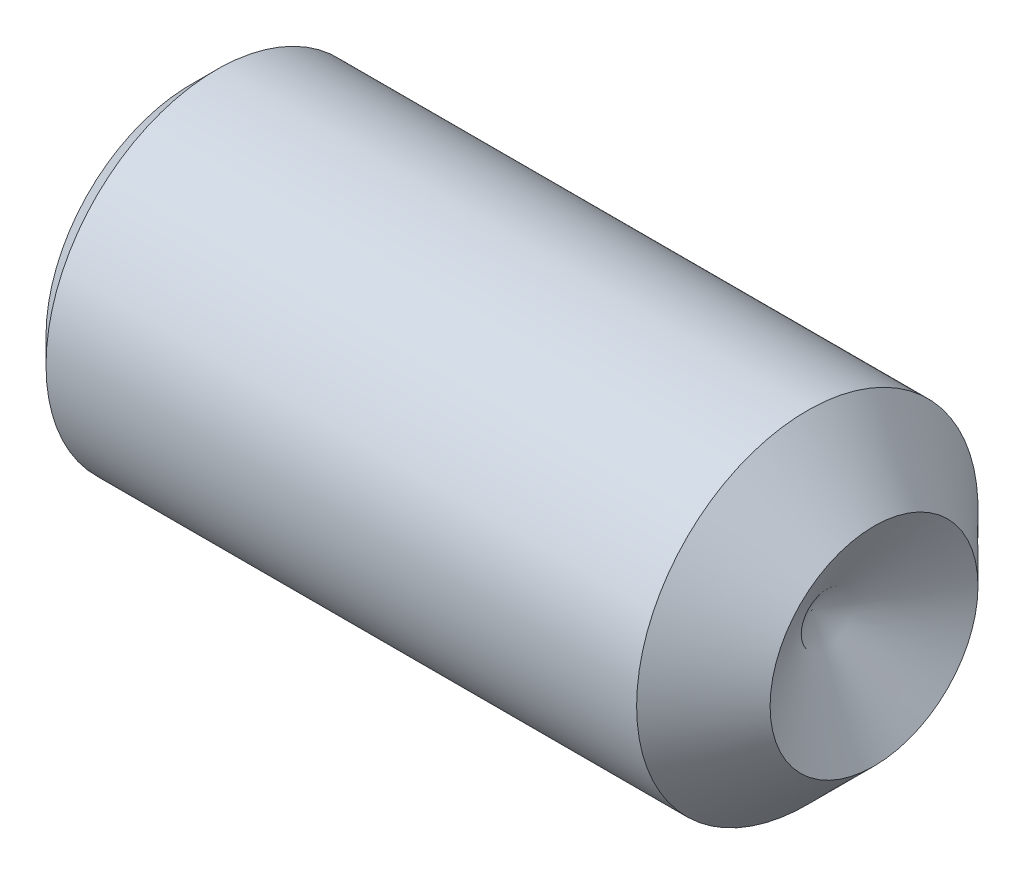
ISO-10303-21;
HEADER;
FILE_DESCRIPTION(('STEP AP214'),'2;1');
FILE_NAME('part.step','',(''),(''),'','','');
FILE_SCHEMA(('AUTOMOTIVE_DESIGN { 1 0 10303 214 1 1 1 1 }'));
ENDSEC;
DATA;
#1=APPLICATION_CONTEXT('core data for automotive mechanical design processes');
#2=APPLICATION_PROTOCOL_DEFINITION('international standard','automotive_design',2000,#1);
#3=PRODUCT_CONTEXT('',#1,'mechanical');
#4=PRODUCT('Part','Part','',(#3));
#5=PRODUCT_RELATED_PRODUCT_CATEGORY('part','',(#4));
#6=PRODUCT_DEFINITION_FORMATION('','',#4);
#7=PRODUCT_DEFINITION_CONTEXT('part definition',#1,'design');
#8=PRODUCT_DEFINITION('design','',#6,#7);
#9=PRODUCT_DEFINITION_SHAPE('','',#8);
#10=(LENGTH_UNIT() NAMED_UNIT(*) SI_UNIT(.MILLI.,.METRE.));
#11=(NAMED_UNIT(*) PLANE_ANGLE_UNIT() SI_UNIT($,.RADIAN.));
#12=(NAMED_UNIT(*) SI_UNIT($,.STERADIAN.) SOLID_ANGLE_UNIT());
#13=UNCERTAINTY_MEASURE_WITH_UNIT(LENGTH_MEASURE(1.E-05),#10,'distance_accuracy_value','');
#14=(GEOMETRIC_REPRESENTATION_CONTEXT(3) GLOBAL_UNCERTAINTY_ASSIGNED_CONTEXT((#13)) GLOBAL_UNIT_ASSIGNED_CONTEXT((#10,
#11,#12)) REPRESENTATION_CONTEXT('',''));
#15=CARTESIAN_POINT('',(0.,0.,0.));
#16=DIRECTION('',(0.,0.,1.));
#17=DIRECTION('',(1.,0.,0.));
#18=AXIS2_PLACEMENT_3D('',#15,#16,#17);
#19=CARTESIAN_POINT('',(0.,0.,0.));
#20=DIRECTION('',(-1.,0.,0.));
#21=DIRECTION('',(0.,0.,1.));
#22=AXIS2_PLACEMENT_3D('',#19,#20,#21);
#23=PLANE('',#22);
#24=CARTESIAN_POINT('',(0.,0.,0.));
#25=DIRECTION('',(-1.,0.,0.));
#26=DIRECTION('',(0.,0.,1.));
#27=AXIS2_PLACEMENT_3D('',#24,#25,#26);
#28=CIRCLE('',#27,10.81024);
#29=CARTESIAN_POINT('',(0.,0.,10.81024));
#30=VERTEX_POINT('',#29);
#31=EDGE_CURVE('E11',#30,#30,#28,.T.);
#32=ORIENTED_EDGE('',*,*,#31,.T.);
#33=EDGE_LOOP('',(#32));
#34=FACE_BOUND('',#33,.T.);
#35=DIRECTION('',(0.,0.,-1.));
#36=VECTOR('',#35,1.);
#37=CARTESIAN_POINT('',(0.,7.1374,4.12077981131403));
#38=LINE('',#37,#36);
#39=CARTESIAN_POINT('',(0.,7.1374,4.12077981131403));
#40=VERTEX_POINT('',#39);
#41=CARTESIAN_POINT('',(0.,7.1374,-4.12077981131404));
#42=VERTEX_POINT('',#41);
#43=EDGE_CURVE('E100',#40,#42,#38,.T.);
#44=ORIENTED_EDGE('',*,*,#43,.F.);
#45=DIRECTION('',(0.,-0.866025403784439,0.5));
#46=VECTOR('',#45,1.);
#47=CARTESIAN_POINT('',(0.,7.1374,4.12077981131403));
#48=LINE('',#47,#46);
#49=CARTESIAN_POINT('',(0.,0.,8.24155962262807));
#50=VERTEX_POINT('',#49);
#51=EDGE_CURVE('E53',#40,#50,#48,.T.);
#52=ORIENTED_EDGE('',*,*,#51,.T.);
#53=DIRECTION('',(0.,0.866025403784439,0.5));
#54=VECTOR('',#53,1.);
#55=CARTESIAN_POINT('',(0.,-7.13739999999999,4.12077981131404));
#56=LINE('',#55,#54);
#57=CARTESIAN_POINT('',(0.,-7.13739999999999,4.12077981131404));
#58=VERTEX_POINT('',#57);
#59=EDGE_CURVE('E106',#58,#50,#56,.T.);
#60=ORIENTED_EDGE('',*,*,#59,.F.);
#61=DIRECTION('',(0.,0.,-1.));
#62=VECTOR('',#61,1.);
#63=CARTESIAN_POINT('',(0.,-7.13739999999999,4.12077981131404));
#64=LINE('',#63,#62);
#65=CARTESIAN_POINT('',(0.,-7.13739999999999,-4.12077981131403));
#66=VERTEX_POINT('',#65);
#67=EDGE_CURVE('E126',#58,#66,#64,.T.);
#68=ORIENTED_EDGE('',*,*,#67,.T.);
#69=DIRECTION('',(0.,0.866025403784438,-0.500000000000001));
#70=VECTOR('',#69,1.);
#71=CARTESIAN_POINT('',(0.,-7.13739999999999,-4.12077981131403));
#72=LINE('',#71,#70);
#73=CARTESIAN_POINT('',(0.,0.,-8.24155962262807));
#74=VERTEX_POINT('',#73);
#75=EDGE_CURVE('E129',#66,#74,#72,.T.);
#76=ORIENTED_EDGE('',*,*,#75,.T.);
#77=DIRECTION('',(0.,-0.866025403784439,-0.5));
#78=VECTOR('',#77,1.);
#79=CARTESIAN_POINT('',(0.,7.1374,-4.12077981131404));
#80=LINE('',#79,#78);
#81=EDGE_CURVE('E132',#42,#74,#80,.T.);
#82=ORIENTED_EDGE('',*,*,#81,.F.);
#83=EDGE_LOOP('',(#44,#52,#60,#68,#76,#82));
#84=FACE_BOUND('',#83,.T.);
#85=ADVANCED_FACE('F39',(#34,#84),#23,.T.);
#86=CARTESIAN_POINT('',(0.,0.,0.));
#87=DIRECTION('',(1.,0.,0.));
#88=DIRECTION('',(0.,0.,-1.));
#89=AXIS2_PLACEMENT_3D('',#86,#87,#88);
#90=CONICAL_SURFACE('',#89,10.81024,0.785398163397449);
#91=CARTESIAN_POINT('',(1.88976,0.,0.));
#92=DIRECTION('',(-1.,0.,0.));
#93=DIRECTION('',(0.,0.,1.));
#94=AXIS2_PLACEMENT_3D('',#91,#92,#93);
#95=CIRCLE('',#94,12.7);
#96=CARTESIAN_POINT('',(1.88976,0.,12.7));
#97=VERTEX_POINT('',#96);
#98=EDGE_CURVE('E46',#97,#97,#95,.T.);
#99=ORIENTED_EDGE('',*,*,#98,.T.);
#100=EDGE_LOOP('',(#99));
#101=FACE_BOUND('',#100,.T.);
#102=ORIENTED_EDGE('',*,*,#31,.F.);
#103=EDGE_LOOP('',(#102));
#104=FACE_BOUND('',#103,.T.);
#105=ADVANCED_FACE('F152',(#101,#104),#90,.T.);
#106=CARTESIAN_POINT('',(-12.7,0.,0.));
#107=DIRECTION('',(-1.,0.,0.));
#108=DIRECTION('',(0.,0.,1.));
#109=AXIS2_PLACEMENT_3D('',#106,#107,#108);
#110=CYLINDRICAL_SURFACE('',#109,12.7);
#111=CARTESIAN_POINT('',(45.8343,0.,0.));
#112=DIRECTION('',(-1.,0.,0.));
#113=DIRECTION('',(0.,0.,1.));
#114=AXIS2_PLACEMENT_3D('',#111,#112,#113);
#115=CIRCLE('',#114,12.7);
#116=CARTESIAN_POINT('',(45.8343,0.,12.7));
#117=VERTEX_POINT('',#116);
#118=EDGE_CURVE('E147',#117,#117,#115,.T.);
#119=ORIENTED_EDGE('',*,*,#118,.T.);
#120=EDGE_LOOP('',(#119));
#121=FACE_BOUND('',#120,.T.);
#122=ORIENTED_EDGE('',*,*,#98,.F.);
#123=EDGE_LOOP('',(#122));
#124=FACE_BOUND('',#123,.T.);
#125=ADVANCED_FACE('F155',(#121,#124),#110,.T.);
#126=CARTESIAN_POINT('',(45.8343,0.,0.));
#127=DIRECTION('',(-1.,0.,0.));
#128=DIRECTION('',(0.,0.,1.));
#129=AXIS2_PLACEMENT_3D('',#126,#127,#128);
#130=CONICAL_SURFACE('',#129,12.7,0.785398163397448);
#131=CARTESIAN_POINT('',(50.8,0.,0.));
#132=DIRECTION('',(-1.,0.,0.));
#133=DIRECTION('',(0.,0.,1.));
#134=AXIS2_PLACEMENT_3D('',#131,#132,#133);
#135=CIRCLE('',#134,7.7343);
#136=CARTESIAN_POINT('',(50.8,0.,7.7343));
#137=VERTEX_POINT('',#136);
#138=EDGE_CURVE('E107',#137,#137,#135,.T.);
#139=ORIENTED_EDGE('',*,*,#138,.T.);
#140=EDGE_LOOP('',(#139));
#141=FACE_BOUND('',#140,.T.);
#142=ORIENTED_EDGE('',*,*,#118,.F.);
#143=EDGE_LOOP('',(#142));
#144=FACE_BOUND('',#143,.T.);
#145=ADVANCED_FACE('F157',(#141,#144),#130,.T.);
#146=CARTESIAN_POINT('',(46.1527637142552,0.,0.));
#147=DIRECTION('',(1.,0.,0.));
#148=DIRECTION('',(0.,0.,-1.));
#149=AXIS2_PLACEMENT_3D('',#146,#147,#148);
#150=CONICAL_SURFACE('',#149,0.,1.02974425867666);
#151=ORIENTED_EDGE('',*,*,#138,.F.);
#152=EDGE_LOOP('',(#151));
#153=FACE_BOUND('',#152,.T.);
#154=CARTESIAN_POINT('',(46.1527637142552,0.,0.));
#155=VERTEX_POINT('',#154);
#156=VERTEX_LOOP('',#155);
#157=FACE_BOUND('',#156,.T.);
#158=ADVANCED_FACE('F164',(#153,#157),#150,.F.);
#159=CARTESIAN_POINT('',(14.2748,7.1374,4.12077981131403));
#160=DIRECTION('',(0.,-0.5,-0.866025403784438));
#161=DIRECTION('',(0.,0.866025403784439,-0.5));
#162=AXIS2_PLACEMENT_3D('',#159,#160,#161);
#163=PLANE('',#162);
#164=ORIENTED_EDGE('',*,*,#51,.F.);
#165=DIRECTION('',(-1.,0.,0.));
#166=VECTOR('',#165,1.);
#167=CARTESIAN_POINT('',(14.2748,7.1374,4.12077981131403));
#168=LINE('',#167,#166);
#169=CARTESIAN_POINT('',(14.2748,7.1374,4.12077981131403));
#170=VERTEX_POINT('',#169);
#171=EDGE_CURVE('E94',#170,#40,#168,.T.);
#172=ORIENTED_EDGE('',*,*,#171,.F.);
#173=DIRECTION('',(0.,-0.866025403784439,0.5));
#174=VECTOR('',#173,1.);
#175=CARTESIAN_POINT('',(14.2748,7.1374,4.12077981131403));
#176=LINE('',#175,#174);
#177=CARTESIAN_POINT('',(14.2748,0.,8.24155962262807));
#178=VERTEX_POINT('',#177);
#179=EDGE_CURVE('E89',#170,#178,#176,.T.);
#180=ORIENTED_EDGE('',*,*,#179,.T.);
#181=DIRECTION('',(-1.,0.,0.));
#182=VECTOR('',#181,1.);
#183=CARTESIAN_POINT('',(14.2748,0.,8.24155962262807));
#184=LINE('',#183,#182);
#185=EDGE_CURVE('E92',#178,#50,#184,.T.);
#186=ORIENTED_EDGE('',*,*,#185,.T.);
#187=EDGE_LOOP('',(#164,#172,#180,#186));
#188=FACE_BOUND('',#187,.T.);
#189=ADVANCED_FACE('F91',(#188),#163,.T.);
#190=CARTESIAN_POINT('',(14.2748,-7.13739999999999,4.12077981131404));
#191=DIRECTION('',(0.,-0.5,0.866025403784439));
#192=DIRECTION('',(0.,-0.866025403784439,-0.5));
#193=AXIS2_PLACEMENT_3D('',#190,#191,#192);
#194=PLANE('',#193);
#195=ORIENTED_EDGE('',*,*,#59,.T.);
#196=ORIENTED_EDGE('',*,*,#185,.F.);
#197=DIRECTION('',(0.,0.866025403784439,0.5));
#198=VECTOR('',#197,1.);
#199=CARTESIAN_POINT('',(14.2748,-7.13739999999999,4.12077981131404));
#200=LINE('',#199,#198);
#201=CARTESIAN_POINT('',(14.2748,-7.13739999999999,4.12077981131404));
#202=VERTEX_POINT('',#201);
#203=EDGE_CURVE('E99',#202,#178,#200,.T.);
#204=ORIENTED_EDGE('',*,*,#203,.F.);
#205=DIRECTION('',(-1.,0.,0.));
#206=VECTOR('',#205,1.);
#207=CARTESIAN_POINT('',(14.2748,-7.13739999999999,4.12077981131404));
#208=LINE('',#207,#206);
#209=EDGE_CURVE('E108',#202,#58,#208,.T.);
#210=ORIENTED_EDGE('',*,*,#209,.T.);
#211=EDGE_LOOP('',(#195,#196,#204,#210));
#212=FACE_BOUND('',#211,.T.);
#213=ADVANCED_FACE('F104',(#212),#194,.F.);
#214=CARTESIAN_POINT('',(14.2748,-7.13739999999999,4.12077981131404));
#215=DIRECTION('',(0.,1.,0.));
#216=DIRECTION('',(0.,0.,1.));
#217=AXIS2_PLACEMENT_3D('',#214,#215,#216);
#218=PLANE('',#217);
#219=ORIENTED_EDGE('',*,*,#67,.F.);
#220=ORIENTED_EDGE('',*,*,#209,.F.);
#221=DIRECTION('',(0.,0.,-1.));
#222=VECTOR('',#221,1.);
#223=CARTESIAN_POINT('',(14.2748,-7.13739999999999,4.12077981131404));
#224=LINE('',#223,#222);
#225=CARTESIAN_POINT('',(14.2748,-7.13739999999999,-4.12077981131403));
#226=VERTEX_POINT('',#225);
#227=EDGE_CURVE('E113',#202,#226,#224,.T.);
#228=ORIENTED_EDGE('',*,*,#227,.T.);
#229=DIRECTION('',(-1.,0.,0.));
#230=VECTOR('',#229,1.);
#231=CARTESIAN_POINT('',(14.2748,-7.13739999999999,-4.12077981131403));
#232=LINE('',#231,#230);
#233=EDGE_CURVE('E142',#226,#66,#232,.T.);
#234=ORIENTED_EDGE('',*,*,#233,.T.);
#235=EDGE_LOOP('',(#219,#220,#228,#234));
#236=FACE_BOUND('',#235,.T.);
#237=ADVANCED_FACE('F189',(#236),#218,.T.);
#238=CARTESIAN_POINT('',(14.2748,-7.13739999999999,-4.12077981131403));
#239=DIRECTION('',(0.,0.500000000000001,0.866025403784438));
#240=DIRECTION('',(0.,-0.866025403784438,0.500000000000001));
#241=AXIS2_PLACEMENT_3D('',#238,#239,#240);
#242=PLANE('',#241);
#243=ORIENTED_EDGE('',*,*,#75,.F.);
#244=ORIENTED_EDGE('',*,*,#233,.F.);
#245=DIRECTION('',(0.,0.866025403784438,-0.500000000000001));
#246=VECTOR('',#245,1.);
#247=CARTESIAN_POINT('',(14.2748,-7.13739999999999,-4.12077981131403));
#248=LINE('',#247,#246);
#249=CARTESIAN_POINT('',(14.2748,0.,-8.24155962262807));
#250=VERTEX_POINT('',#249);
#251=EDGE_CURVE('E115',#226,#250,#248,.T.);
#252=ORIENTED_EDGE('',*,*,#251,.T.);
#253=DIRECTION('',(-1.,0.,0.));
#254=VECTOR('',#253,1.);
#255=CARTESIAN_POINT('',(14.2748,0.,-8.24155962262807));
#256=LINE('',#255,#254);
#257=EDGE_CURVE('E140',#250,#74,#256,.T.);
#258=ORIENTED_EDGE('',*,*,#257,.T.);
#259=EDGE_LOOP('',(#243,#244,#252,#258));
#260=FACE_BOUND('',#259,.T.);
#261=ADVANCED_FACE('F185',(#260),#242,.T.);
#262=CARTESIAN_POINT('',(14.2748,7.1374,-4.12077981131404));
#263=DIRECTION('',(0.,0.5,-0.866025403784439));
#264=DIRECTION('',(0.,0.866025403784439,0.5));
#265=AXIS2_PLACEMENT_3D('',#262,#263,#264);
#266=PLANE('',#265);
#267=ORIENTED_EDGE('',*,*,#81,.T.);
#268=ORIENTED_EDGE('',*,*,#257,.F.);
#269=DIRECTION('',(0.,-0.866025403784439,-0.5));
#270=VECTOR('',#269,1.);
#271=CARTESIAN_POINT('',(14.2748,7.1374,-4.12077981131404));
#272=LINE('',#271,#270);
#273=CARTESIAN_POINT('',(14.2748,7.1374,-4.12077981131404));
#274=VERTEX_POINT('',#273);
#275=EDGE_CURVE('E119',#274,#250,#272,.T.);
#276=ORIENTED_EDGE('',*,*,#275,.F.);
#277=DIRECTION('',(-1.,0.,0.));
#278=VECTOR('',#277,1.);
#279=CARTESIAN_POINT('',(14.2748,7.1374,-4.12077981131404));
#280=LINE('',#279,#278);
#281=EDGE_CURVE('E138',#274,#42,#280,.T.);
#282=ORIENTED_EDGE('',*,*,#281,.T.);
#283=EDGE_LOOP('',(#267,#268,#276,#282));
#284=FACE_BOUND('',#283,.T.);
#285=ADVANCED_FACE('F182',(#284),#266,.F.);
#286=CARTESIAN_POINT('',(14.2748,7.1374,4.12077981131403));
#287=DIRECTION('',(0.,1.,0.));
#288=DIRECTION('',(0.,0.,1.));
#289=AXIS2_PLACEMENT_3D('',#286,#287,#288);
#290=PLANE('',#289);
#291=ORIENTED_EDGE('',*,*,#43,.T.);
#292=ORIENTED_EDGE('',*,*,#281,.F.);
#293=DIRECTION('',(0.,0.,-1.));
#294=VECTOR('',#293,1.);
#295=CARTESIAN_POINT('',(14.2748,7.1374,4.12077981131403));
#296=LINE('',#295,#294);
#297=EDGE_CURVE('E122',#170,#274,#296,.T.);
#298=ORIENTED_EDGE('',*,*,#297,.F.);
#299=ORIENTED_EDGE('',*,*,#171,.T.);
#300=EDGE_LOOP('',(#291,#292,#298,#299));
#301=FACE_BOUND('',#300,.T.);
#302=ADVANCED_FACE('F178',(#301),#290,.F.);
#303=CARTESIAN_POINT('',(14.2748,14.2748,0.));
#304=DIRECTION('',(1.,0.,0.));
#305=DIRECTION('',(0.,0.,-1.));
#306=AXIS2_PLACEMENT_3D('',#303,#304,#305);
#307=PLANE('',#306);
#308=ORIENTED_EDGE('',*,*,#179,.F.);
#309=ORIENTED_EDGE('',*,*,#297,.T.);
#310=ORIENTED_EDGE('',*,*,#275,.T.);
#311=ORIENTED_EDGE('',*,*,#251,.F.);
#312=ORIENTED_EDGE('',*,*,#227,.F.);
#313=ORIENTED_EDGE('',*,*,#203,.T.);
#314=EDGE_LOOP('',(#308,#309,#310,#311,#312,#313));
#315=FACE_BOUND('',#314,.T.);
#316=ADVANCED_FACE('F111',(#315),#307,.F.);
#317=CLOSED_SHELL('',(#85,#105,#125,#145,#158,#189,#213,#237,#261,#285,#302,#316));
#318=MANIFOLD_SOLID_BREP('B2',#317);
#319=ADVANCED_BREP_SHAPE_REPRESENTATION('',(#18,#318),#14);
#320=SHAPE_DEFINITION_REPRESENTATION(#9,#319);
ENDSEC;
END-ISO-10303-21;
